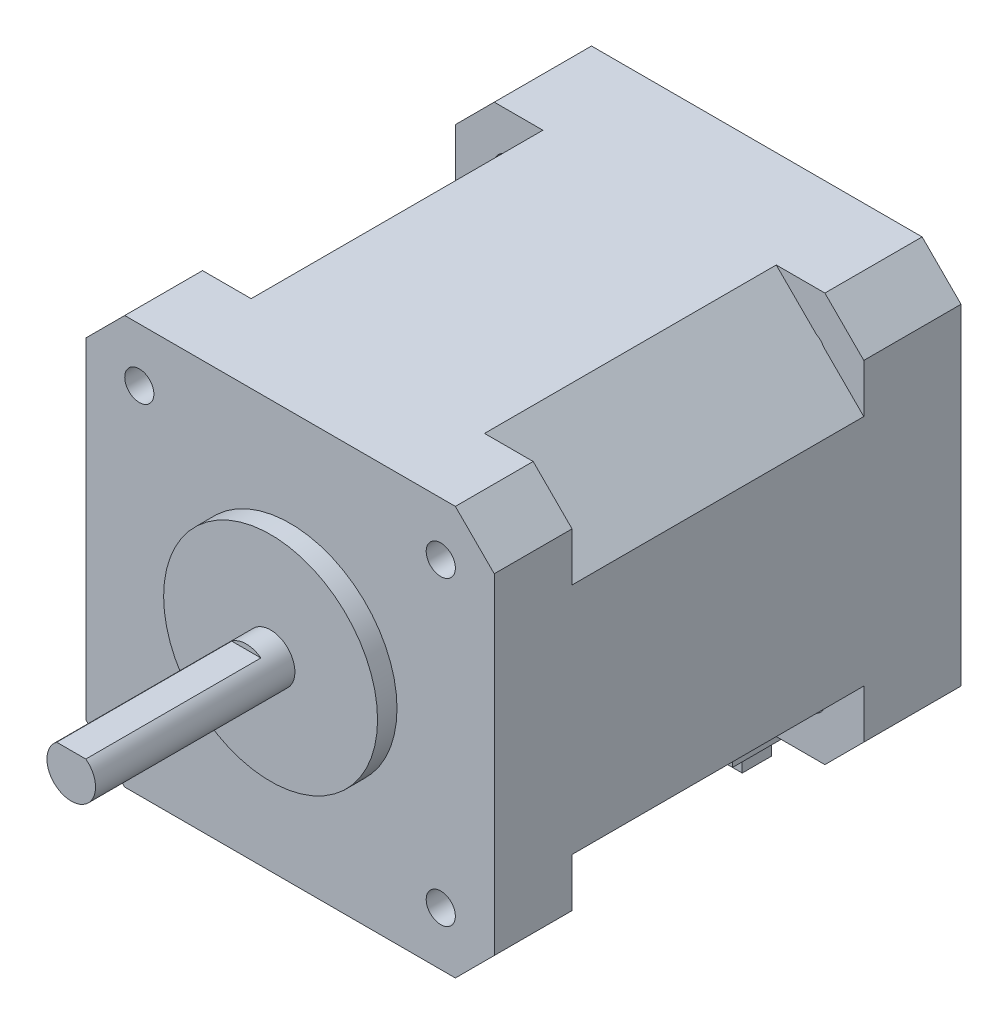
from build123d import *

# Parameters (mm, degrees)
BOSS_EXTRUDE1_DEPTH      = 18
SKETCH2_R                = 2.5
BOSS_EXTRUDE2_DEPTH      = 4.5
SKETCH3_R                = 11
BOSS_EXTRUDE3_DEPTH      = 2
SKETCH4_R                = 1.5
BOSS_EXTRUDE4_DEPTH      = 48
CUT_EXTRUDE1_START       = -10
CUT_EXTRUDE1_DEPTH       = 30
BOSS_EXTRUDE5_DEPTH      = 43.5
SKETCH7_W                = 15
SKETCH7_H                = 10
BOSS_EXTRUDE6_DEPTH      = 10
SKETCH8_W                = 11
SKETCH8_H                = 5
CUT_EXTRUDE2_DEPTH       = 5
BOSS_EXTRUDE7_DEPTH      = 6
BOSS_EXTRUDE9_DEPTH      = 1
BOSS_EXTRUDE9_DEPTH_BACK = 6


with BuildPart() as part:
    # Sketch1 → Boss-Extrude1 (new body)
    with BuildSketch(Plane.XY):
        with BuildLine():
            Line((-1.5, 2), (1.5, 2))
            ThreePointArc((1.5, 2), (0, -2.5), (-1.5, 2))
        make_face()
    extrude(amount=-BOSS_EXTRUDE1_DEPTH)

    # Sketch2 → Boss-Extrude2 (add)
    with BuildSketch(Plane(origin=(0, 0, -18), x_dir=(-1, 0, 0), z_dir=(0, 0, -1))):
        with Locations(Location((0, 0, 0), (0, 0, 126.869897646))):
            Circle(SKETCH2_R)
    extrude(amount=BOSS_EXTRUDE2_DEPTH)

    # Sketch3 → Boss-Extrude3 (add)
    with BuildSketch(Plane(origin=(0, 0, -22.5), x_dir=(-1, 0, 0), z_dir=(0, 0, -1))):
        Circle(SKETCH3_R)
    extrude(amount=-BOSS_EXTRUDE3_DEPTH)

    # Sketch4 → Boss-Extrude4 (add)
    with BuildSketch(Plane(origin=(0, 0, -22.5), x_dir=(-1, 0, 0), z_dir=(0, 0, -1))):
        Polygon((17, -21), (21, -17), (21, 17), (17, 21), (-17, 21), (-21, 17), (-21, -17), (-17, -21), align=None)
        with Locations((-15.5, 15.5)):
            Circle(SKETCH4_R, mode=Mode.SUBTRACT)
        with Locations((15.5, 15.5)):
            Circle(SKETCH4_R, mode=Mode.SUBTRACT)
        with Locations((15.5, -15.5)):
            Circle(SKETCH4_R, mode=Mode.SUBTRACT)
        with Locations((-15.5, -15.5)):
            Circle(SKETCH4_R, mode=Mode.SUBTRACT)
    extrude(amount=BOSS_EXTRUDE4_DEPTH)

    # Sketch5 → Cut-Extrude1 (cut)
    with BuildSketch(Plane(origin=(0, 0, -70.5), x_dir=(-1, 0, 0), z_dir=(0, 0, -1)).offset(CUT_EXTRUDE1_START)):
        Polygon((21, -12), (12, -21), (21, -21), align=None)
        Polygon((21, 12), (12, 21), (21, 21), align=None)
        Polygon((-12, 21), (-21, 12), (-21, 21), align=None)
        Polygon((-12, -21), (-21, -12), (-21, -21), align=None)
    extrude(amount=-CUT_EXTRUDE1_DEPTH, mode=Mode.SUBTRACT)

    # Sketch6 → Boss-Extrude5 (add)
    with BuildSketch(Plane(origin=(0, 0, -70.5), x_dir=(-1, 0, 0), z_dir=(0, 0, -1))):
        Polygon((16.146446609, -16.853553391), (12, -21), (-12, -21), (-16.146446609, -16.853553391), (-16.853553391, -16.146446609), (-21, -12), (-21, 12), (-16.853553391, 16.146446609), (-16.146446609, 16.853553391), (-12, 21), (12, 21), (16.146446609, 16.853553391), (16.853553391, 16.146446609), (21, 12), (21, -12), (16.853553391, -16.146446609), align=None)
    extrude(amount=-BOSS_EXTRUDE5_DEPTH)

    # Sketch7 → Boss-Extrude6 (add)
    with BuildSketch(Plane(origin=(0, 0, -70.5), x_dir=(-1, 0, 0), z_dir=(0, 0, -1))):
        with Locations((0, -21)):
            Rectangle(SKETCH7_W, SKETCH7_H)
    extrude(amount=-BOSS_EXTRUDE6_DEPTH)

    # Sketch8 → Cut-Extrude2 (cut)
    with BuildSketch(Plane.XY.offset(-60.5)):
        with Locations((0, -23.5)):
            Rectangle(SKETCH8_W, SKETCH8_H)
    extrude(amount=-CUT_EXTRUDE2_DEPTH, mode=Mode.SUBTRACT)

    # Sketch9 → Boss-Extrude7 (add)
    with BuildSketch(Plane.XZ.offset(21)):
        Polygon((-4.5, -62.5), (-4.5, -65.5), (4.5, -65.5), (4.5, -62.5), (3.5, -62.5), (3.5, -64.831429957), (2.5, -64.831429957), (2.5, -62.5), (1.5, -62.5), (1.5, -64.831429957), (0.5, -64.831429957), (0.5, -62.5), (-0.5, -62.5), (-0.5, -64.831429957), (-1.5, -64.831429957), (-1.5, -62.5), (-2.5, -62.5), (-2.5, -64.831429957), (-3.5, -64.831429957), (-3.5, -62.5), align=None)
    extrude(amount=BOSS_EXTRUDE7_DEPTH)

    # Sketch10 → Boss-Extrude9 (add, two sides: drawn at the far end of the back side and taken through both)
    with BuildSketch(Plane.XZ.offset(27).offset(-BOSS_EXTRUDE9_DEPTH_BACK)):
        Polygon((4.5, -64.831429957), (-4.5, -64.831429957), (-4.5, -62.5), (-6.5, -62.5), (-6.5, -65.5), (6.5, -65.5), (6.5, -62.5), (4.5, -62.5), align=None)
    extrude(amount=BOSS_EXTRUDE9_DEPTH + BOSS_EXTRUDE9_DEPTH_BACK)


solid = part.part
